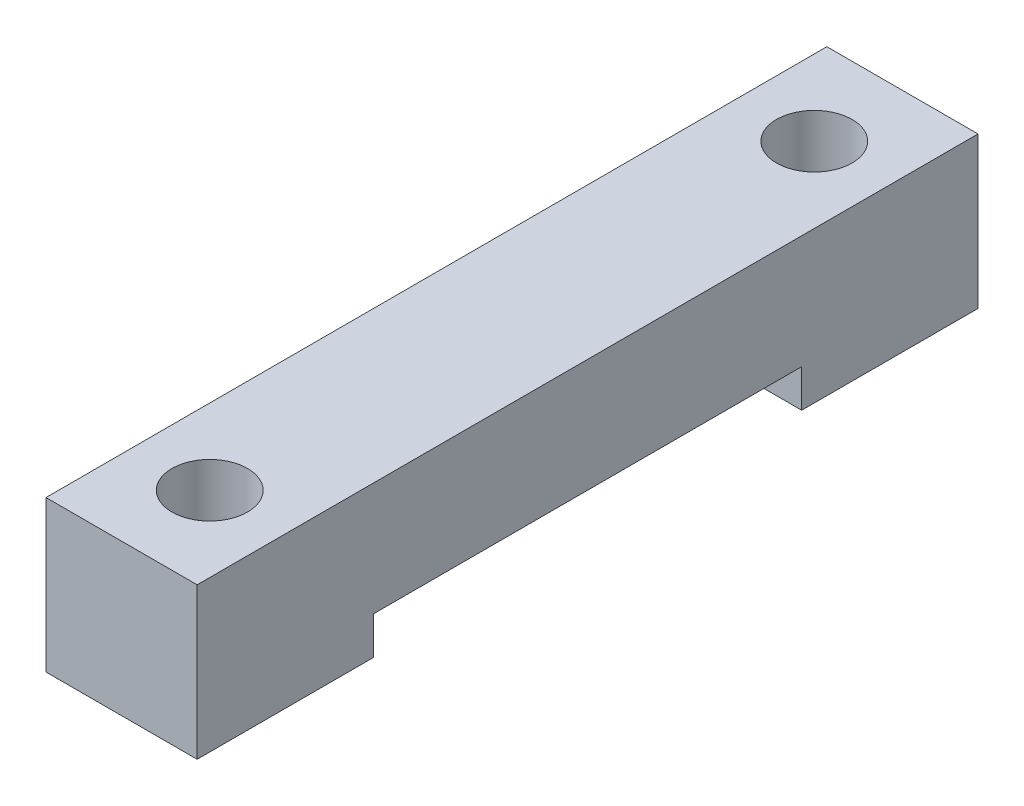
from build123d import *

# Parameters (mm, degrees)
SKETCH1_W      = 12
SKETCH1_H      = 62
SKETCH1_R      = 3
EXTRUDE1_DEPTH = 12
SKETCH2_W      = 34
SKETCH2_H      = 3
EXTRUDE2_DEPTH = 65.28063472


with BuildPart() as part:
    # Sketch1 → Extrude1 (new body)
    with BuildSketch(Plane(origin=(0, 0, 0), x_dir=(1, 0, 0), z_dir=(0, 1, 0))):
        with Locations((6, 31)):
            Rectangle(SKETCH1_W, SKETCH1_H)
        with Locations(Location((6, 55, 0), (0, 0, 270))):
            Circle(SKETCH1_R, mode=Mode.SUBTRACT)
        with Locations(Location((6, 7, 0), (0, 0, 270))):
            Circle(SKETCH1_R, mode=Mode.SUBTRACT)
    extrude(amount=EXTRUDE1_DEPTH)

    # Sketch2 → Extrude2 (cut, through all)
    with BuildSketch(Plane(origin=(12, 0, 0), x_dir=(0, 0, -1), z_dir=(1, 0, 0))):
        with Locations((31, 1.5)):
            Rectangle(SKETCH2_W, SKETCH2_H)
    extrude(amount=-EXTRUDE2_DEPTH, mode=Mode.SUBTRACT)


solid = part.part
